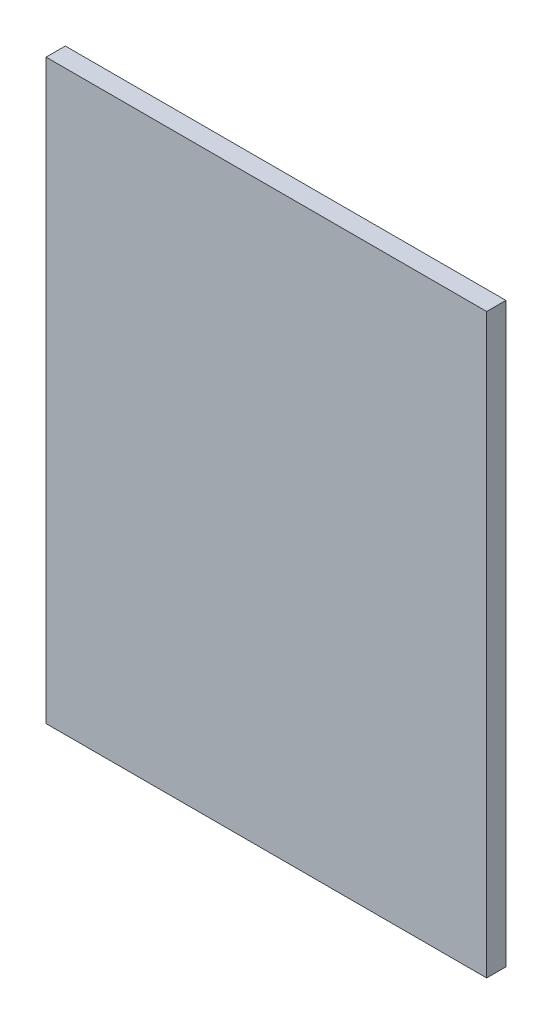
from build123d import *

# Parameters (mm, degrees)
SKETCH1_W           = 114.5
SKETCH1_H           = 150
BOSS_EXTRUDE1_DEPTH = 5


with BuildPart() as part:
    # Sketch1 → Boss-Extrude1 (new body)
    with BuildSketch(Plane.XY):
        with Locations((57.25, 75)):
            Rectangle(SKETCH1_W, SKETCH1_H)
    extrude(amount=BOSS_EXTRUDE1_DEPTH)


solid = part.part
